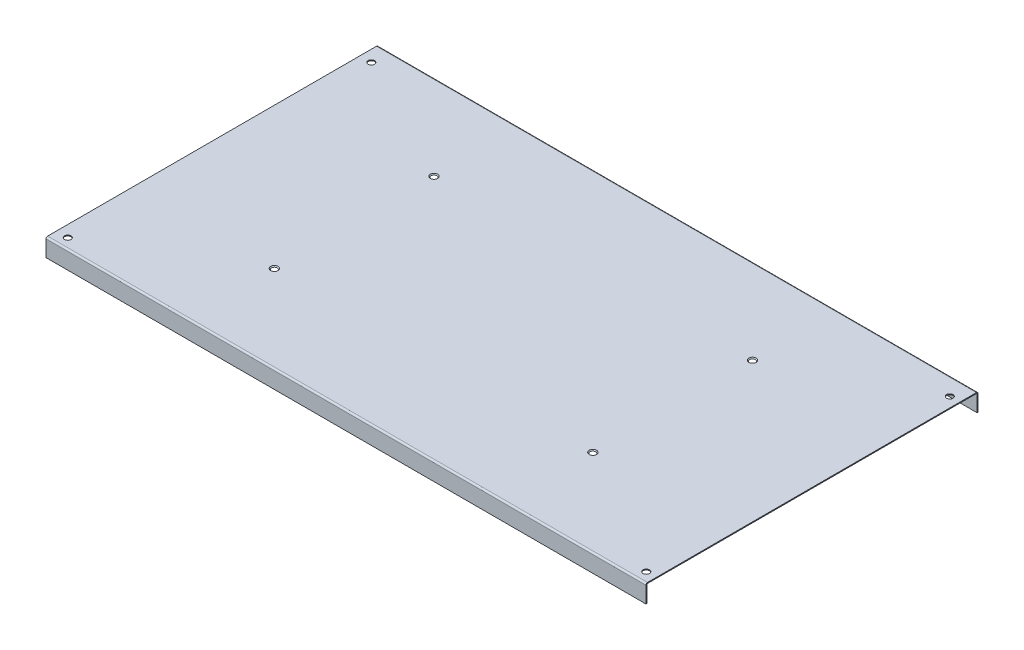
ISO-10303-21;
HEADER;
FILE_DESCRIPTION(('STEP AP214'),'2;1');
FILE_NAME('part.step','',(''),(''),'','','');
FILE_SCHEMA(('AUTOMOTIVE_DESIGN { 1 0 10303 214 1 1 1 1 }'));
ENDSEC;
DATA;
#1=APPLICATION_CONTEXT('core data for automotive mechanical design processes');
#2=APPLICATION_PROTOCOL_DEFINITION('international standard','automotive_design',2000,#1);
#3=PRODUCT_CONTEXT('',#1,'mechanical');
#4=PRODUCT('Part','Part','',(#3));
#5=PRODUCT_RELATED_PRODUCT_CATEGORY('part','',(#4));
#6=PRODUCT_DEFINITION_FORMATION('','',#4);
#7=PRODUCT_DEFINITION_CONTEXT('part definition',#1,'design');
#8=PRODUCT_DEFINITION('design','',#6,#7);
#9=PRODUCT_DEFINITION_SHAPE('','',#8);
#10=(LENGTH_UNIT() NAMED_UNIT(*) SI_UNIT(.MILLI.,.METRE.));
#11=(NAMED_UNIT(*) PLANE_ANGLE_UNIT() SI_UNIT($,.RADIAN.));
#12=(NAMED_UNIT(*) SI_UNIT($,.STERADIAN.) SOLID_ANGLE_UNIT());
#13=UNCERTAINTY_MEASURE_WITH_UNIT(LENGTH_MEASURE(1.E-05),#10,'distance_accuracy_value','');
#14=(GEOMETRIC_REPRESENTATION_CONTEXT(3) GLOBAL_UNCERTAINTY_ASSIGNED_CONTEXT((#13)) GLOBAL_UNIT_ASSIGNED_CONTEXT((#10,
#11,#12)) REPRESENTATION_CONTEXT('',''));
#15=CARTESIAN_POINT('',(0.,0.,0.));
#16=DIRECTION('',(0.,0.,1.));
#17=DIRECTION('',(1.,0.,0.));
#18=AXIS2_PLACEMENT_3D('',#15,#16,#17);
#19=CARTESIAN_POINT('',(840.,0.,-465.));
#20=DIRECTION('',(0.,-1.,0.));
#21=DIRECTION('',(0.,0.,-1.));
#22=AXIS2_PLACEMENT_3D('',#19,#20,#21);
#23=PLANE('',#22);
#24=CARTESIAN_POINT('',(198.,0.,-345.25));
#25=DIRECTION('',(0.,-1.,0.));
#26=DIRECTION('',(0.,0.,-1.));
#27=AXIS2_PLACEMENT_3D('',#24,#25,#26);
#28=CIRCLE('',#27,3.89999999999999);
#29=CARTESIAN_POINT('',(198.,0.,-349.15));
#30=VERTEX_POINT('',#29);
#31=EDGE_CURVE('E279',#30,#30,#28,.T.);
#32=ORIENTED_EDGE('',*,*,#31,.F.);
#33=EDGE_LOOP('',(#32));
#34=FACE_BOUND('',#33,.T.);
#35=CARTESIAN_POINT('',(198.,0.,-121.75));
#36=DIRECTION('',(0.,-1.,0.));
#37=DIRECTION('',(0.,0.,-1.));
#38=AXIS2_PLACEMENT_3D('',#35,#36,#37);
#39=CIRCLE('',#38,3.89999999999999);
#40=CARTESIAN_POINT('',(198.,0.,-125.65));
#41=VERTEX_POINT('',#40);
#42=EDGE_CURVE('E273',#41,#41,#39,.T.);
#43=ORIENTED_EDGE('',*,*,#42,.F.);
#44=EDGE_LOOP('',(#43));
#45=FACE_BOUND('',#44,.T.);
#46=CARTESIAN_POINT('',(644.,0.,-121.75));
#47=DIRECTION('',(0.,-1.,0.));
#48=DIRECTION('',(0.,0.,-1.));
#49=AXIS2_PLACEMENT_3D('',#46,#47,#48);
#50=CIRCLE('',#49,3.9);
#51=CARTESIAN_POINT('',(644.,0.,-125.65));
#52=VERTEX_POINT('',#51);
#53=EDGE_CURVE('E267',#52,#52,#50,.T.);
#54=ORIENTED_EDGE('',*,*,#53,.F.);
#55=EDGE_LOOP('',(#54));
#56=FACE_BOUND('',#55,.T.);
#57=CARTESIAN_POINT('',(644.,0.,-345.25));
#58=DIRECTION('',(0.,-1.,0.));
#59=DIRECTION('',(0.,0.,-1.));
#60=AXIS2_PLACEMENT_3D('',#57,#58,#59);
#61=CIRCLE('',#60,3.9);
#62=CARTESIAN_POINT('',(644.,0.,-349.15));
#63=VERTEX_POINT('',#62);
#64=EDGE_CURVE('E261',#63,#63,#61,.T.);
#65=ORIENTED_EDGE('',*,*,#64,.F.);
#66=EDGE_LOOP('',(#65));
#67=FACE_BOUND('',#66,.T.);
#68=CARTESIAN_POINT('',(15.9999999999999,0.,-439.5));
#69=DIRECTION('',(0.,-1.,0.));
#70=DIRECTION('',(0.,0.,-1.));
#71=AXIS2_PLACEMENT_3D('',#68,#69,#70);
#72=CIRCLE('',#71,4.5);
#73=CARTESIAN_POINT('',(15.9999999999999,0.,-444.));
#74=VERTEX_POINT('',#73);
#75=EDGE_CURVE('E258',#74,#74,#72,.T.);
#76=ORIENTED_EDGE('',*,*,#75,.F.);
#77=EDGE_LOOP('',(#76));
#78=FACE_BOUND('',#77,.T.);
#79=CARTESIAN_POINT('',(826.,0.,-439.5));
#80=DIRECTION('',(0.,-1.,0.));
#81=DIRECTION('',(0.,0.,-1.));
#82=AXIS2_PLACEMENT_3D('',#79,#80,#81);
#83=CIRCLE('',#82,4.49999999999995);
#84=CARTESIAN_POINT('',(826.,0.,-444.));
#85=VERTEX_POINT('',#84);
#86=EDGE_CURVE('E252',#85,#85,#83,.T.);
#87=ORIENTED_EDGE('',*,*,#86,.F.);
#88=EDGE_LOOP('',(#87));
#89=FACE_BOUND('',#88,.T.);
#90=CARTESIAN_POINT('',(826.,0.,-14.5));
#91=DIRECTION('',(0.,-1.,0.));
#92=DIRECTION('',(0.,0.,-1.));
#93=AXIS2_PLACEMENT_3D('',#90,#91,#92);
#94=CIRCLE('',#93,4.49999999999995);
#95=CARTESIAN_POINT('',(826.,0.,-19.));
#96=VERTEX_POINT('',#95);
#97=EDGE_CURVE('E246',#96,#96,#94,.T.);
#98=ORIENTED_EDGE('',*,*,#97,.F.);
#99=EDGE_LOOP('',(#98));
#100=FACE_BOUND('',#99,.T.);
#101=CARTESIAN_POINT('',(15.9999999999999,0.,-14.5));
#102=DIRECTION('',(0.,-1.,0.));
#103=DIRECTION('',(0.,0.,-1.));
#104=AXIS2_PLACEMENT_3D('',#101,#102,#103);
#105=CIRCLE('',#104,4.5);
#106=CARTESIAN_POINT('',(15.9999999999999,0.,-19.));
#107=VERTEX_POINT('',#106);
#108=EDGE_CURVE('E240',#107,#107,#105,.T.);
#109=ORIENTED_EDGE('',*,*,#108,.F.);
#110=EDGE_LOOP('',(#109));
#111=FACE_BOUND('',#110,.T.);
#112=DIRECTION('',(0.,0.,-1.));
#113=VECTOR('',#112,1.);
#114=CARTESIAN_POINT('',(840.,0.,-465.));
#115=LINE('',#114,#113);
#116=CARTESIAN_POINT('',(840.,-5.26271734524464E-13,-2.25));
#117=VERTEX_POINT('',#116);
#118=CARTESIAN_POINT('',(840.,0.,-462.75));
#119=VERTEX_POINT('',#118);
#120=EDGE_CURVE('E232',#117,#119,#115,.T.);
#121=ORIENTED_EDGE('',*,*,#120,.F.);
#122=DIRECTION('',(-1.,0.,0.));
#123=VECTOR('',#122,1.);
#124=CARTESIAN_POINT('',(0.,0.,-2.25));
#125=LINE('',#124,#123);
#126=CARTESIAN_POINT('',(0.,0.,-2.25));
#127=VERTEX_POINT('',#126);
#128=EDGE_CURVE('E192',#127,#117,#125,.F.);
#129=ORIENTED_EDGE('',*,*,#128,.F.);
#130=DIRECTION('',(0.,0.,1.));
#131=VECTOR('',#130,1.);
#132=CARTESIAN_POINT('',(0.,0.,-465.));
#133=LINE('',#132,#131);
#134=CARTESIAN_POINT('',(0.,0.,-462.75));
#135=VERTEX_POINT('',#134);
#136=EDGE_CURVE('E221',#135,#127,#133,.T.);
#137=ORIENTED_EDGE('',*,*,#136,.F.);
#138=DIRECTION('',(1.,0.,0.));
#139=VECTOR('',#138,1.);
#140=CARTESIAN_POINT('',(0.,0.,-462.75));
#141=LINE('',#140,#139);
#142=EDGE_CURVE('E234',#135,#119,#141,.T.);
#143=ORIENTED_EDGE('',*,*,#142,.T.);
#144=EDGE_LOOP('',(#121,#129,#137,#143));
#145=FACE_BOUND('',#144,.T.);
#146=ADVANCED_FACE('F53',(#34,#45,#56,#67,#78,#89,#100,#111,#145),#23,.T.);
#147=CARTESIAN_POINT('',(840.,1.25,-465.));
#148=DIRECTION('',(0.,-1.,0.));
#149=DIRECTION('',(0.,0.,-1.));
#150=AXIS2_PLACEMENT_3D('',#147,#148,#149);
#151=PLANE('',#150);
#152=CARTESIAN_POINT('',(198.,1.25,-121.75));
#153=DIRECTION('',(0.,1.,0.));
#154=DIRECTION('',(0.,0.,1.));
#155=AXIS2_PLACEMENT_3D('',#152,#153,#154);
#156=CIRCLE('',#155,5.14999999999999);
#157=CARTESIAN_POINT('',(198.,1.25,-116.6));
#158=VERTEX_POINT('',#157);
#159=EDGE_CURVE('E276',#158,#158,#156,.T.);
#160=ORIENTED_EDGE('',*,*,#159,.F.);
#161=EDGE_LOOP('',(#160));
#162=FACE_BOUND('',#161,.T.);
#163=CARTESIAN_POINT('',(644.,1.25,-345.25));
#164=DIRECTION('',(0.,1.,0.));
#165=DIRECTION('',(0.,0.,1.));
#166=AXIS2_PLACEMENT_3D('',#163,#164,#165);
#167=CIRCLE('',#166,5.14999999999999);
#168=CARTESIAN_POINT('',(644.,1.25,-340.1));
#169=VERTEX_POINT('',#168);
#170=EDGE_CURVE('E264',#169,#169,#167,.T.);
#171=ORIENTED_EDGE('',*,*,#170,.F.);
#172=EDGE_LOOP('',(#171));
#173=FACE_BOUND('',#172,.T.);
#174=CARTESIAN_POINT('',(15.9999999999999,1.25,-439.5));
#175=DIRECTION('',(0.,1.,0.));
#176=DIRECTION('',(0.,0.,1.));
#177=AXIS2_PLACEMENT_3D('',#174,#175,#176);
#178=CIRCLE('',#177,4.5);
#179=CARTESIAN_POINT('',(15.9999999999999,1.25,-435.));
#180=VERTEX_POINT('',#179);
#181=EDGE_CURVE('E255',#180,#180,#178,.T.);
#182=ORIENTED_EDGE('',*,*,#181,.F.);
#183=EDGE_LOOP('',(#182));
#184=FACE_BOUND('',#183,.T.);
#185=CARTESIAN_POINT('',(826.,1.25,-439.5));
#186=DIRECTION('',(0.,1.,0.));
#187=DIRECTION('',(0.,0.,1.));
#188=AXIS2_PLACEMENT_3D('',#185,#186,#187);
#189=CIRCLE('',#188,4.49999999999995);
#190=CARTESIAN_POINT('',(826.,1.25,-435.));
#191=VERTEX_POINT('',#190);
#192=EDGE_CURVE('E249',#191,#191,#189,.T.);
#193=ORIENTED_EDGE('',*,*,#192,.F.);
#194=EDGE_LOOP('',(#193));
#195=FACE_BOUND('',#194,.T.);
#196=CARTESIAN_POINT('',(826.,1.25,-14.5));
#197=DIRECTION('',(0.,1.,0.));
#198=DIRECTION('',(0.,0.,1.));
#199=AXIS2_PLACEMENT_3D('',#196,#197,#198);
#200=CIRCLE('',#199,4.49999999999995);
#201=CARTESIAN_POINT('',(826.,1.25,-10.0000000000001));
#202=VERTEX_POINT('',#201);
#203=EDGE_CURVE('E243',#202,#202,#200,.T.);
#204=ORIENTED_EDGE('',*,*,#203,.F.);
#205=EDGE_LOOP('',(#204));
#206=FACE_BOUND('',#205,.T.);
#207=CARTESIAN_POINT('',(15.9999999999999,1.25,-14.5));
#208=DIRECTION('',(0.,1.,0.));
#209=DIRECTION('',(0.,0.,1.));
#210=AXIS2_PLACEMENT_3D('',#207,#208,#209);
#211=CIRCLE('',#210,4.5);
#212=CARTESIAN_POINT('',(15.9999999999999,1.25,-10.));
#213=VERTEX_POINT('',#212);
#214=EDGE_CURVE('E237',#213,#213,#211,.T.);
#215=ORIENTED_EDGE('',*,*,#214,.F.);
#216=EDGE_LOOP('',(#215));
#217=FACE_BOUND('',#216,.T.);
#218=CARTESIAN_POINT('',(644.,1.25,-121.75));
#219=DIRECTION('',(0.,1.,0.));
#220=DIRECTION('',(0.,0.,1.));
#221=AXIS2_PLACEMENT_3D('',#218,#219,#220);
#222=CIRCLE('',#221,5.14999999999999);
#223=CARTESIAN_POINT('',(644.,1.25,-116.6));
#224=VERTEX_POINT('',#223);
#225=EDGE_CURVE('E270',#224,#224,#222,.T.);
#226=ORIENTED_EDGE('',*,*,#225,.F.);
#227=EDGE_LOOP('',(#226));
#228=FACE_BOUND('',#227,.T.);
#229=CARTESIAN_POINT('',(198.,1.25,-345.25));
#230=DIRECTION('',(0.,1.,0.));
#231=DIRECTION('',(0.,0.,1.));
#232=AXIS2_PLACEMENT_3D('',#229,#230,#231);
#233=CIRCLE('',#232,5.14999999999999);
#234=CARTESIAN_POINT('',(198.,1.25,-340.1));
#235=VERTEX_POINT('',#234);
#236=EDGE_CURVE('E282',#235,#235,#233,.T.);
#237=ORIENTED_EDGE('',*,*,#236,.F.);
#238=EDGE_LOOP('',(#237));
#239=FACE_BOUND('',#238,.T.);
#240=DIRECTION('',(-1.,0.,0.));
#241=VECTOR('',#240,1.);
#242=CARTESIAN_POINT('',(0.,1.25000000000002,-2.24999999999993));
#243=LINE('',#242,#241);
#244=CARTESIAN_POINT('',(0.,1.25000000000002,-2.24999999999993));
#245=VERTEX_POINT('',#244);
#246=CARTESIAN_POINT('',(840.,1.25,-2.25));
#247=VERTEX_POINT('',#246);
#248=EDGE_CURVE('E197',#245,#247,#243,.F.);
#249=ORIENTED_EDGE('',*,*,#248,.T.);
#250=DIRECTION('',(0.,0.,-1.));
#251=VECTOR('',#250,1.);
#252=CARTESIAN_POINT('',(840.,1.25,-465.));
#253=LINE('',#252,#251);
#254=CARTESIAN_POINT('',(840.,1.25,-462.75));
#255=VERTEX_POINT('',#254);
#256=EDGE_CURVE('E225',#247,#255,#253,.T.);
#257=ORIENTED_EDGE('',*,*,#256,.T.);
#258=DIRECTION('',(1.,0.,0.));
#259=VECTOR('',#258,1.);
#260=CARTESIAN_POINT('',(0.,1.24999999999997,-462.75));
#261=LINE('',#260,#259);
#262=CARTESIAN_POINT('',(0.,1.24999999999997,-462.75));
#263=VERTEX_POINT('',#262);
#264=EDGE_CURVE('E285',#263,#255,#261,.T.);
#265=ORIENTED_EDGE('',*,*,#264,.F.);
#266=DIRECTION('',(0.,0.,1.));
#267=VECTOR('',#266,1.);
#268=CARTESIAN_POINT('',(0.,1.25,-465.));
#269=LINE('',#268,#267);
#270=EDGE_CURVE('E227',#263,#245,#269,.T.);
#271=ORIENTED_EDGE('',*,*,#270,.T.);
#272=EDGE_LOOP('',(#249,#257,#265,#271));
#273=FACE_BOUND('',#272,.T.);
#274=ADVANCED_FACE('F338',(#162,#173,#184,#195,#206,#217,#228,#239,#273),#151,.F.);
#275=CARTESIAN_POINT('',(0.,-1918.05897980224,-465.));
#276=DIRECTION('',(-1.,0.,0.));
#277=DIRECTION('',(0.,0.,1.));
#278=AXIS2_PLACEMENT_3D('',#275,#276,#277);
#279=PLANE('',#278);
#280=ORIENTED_EDGE('',*,*,#136,.T.);
#281=DIRECTION('',(0.,1.,0.));
#282=VECTOR('',#281,1.);
#283=CARTESIAN_POINT('',(0.,0.,-2.25));
#284=LINE('',#283,#282);
#285=EDGE_CURVE('E202',#127,#245,#284,.T.);
#286=ORIENTED_EDGE('',*,*,#285,.T.);
#287=ORIENTED_EDGE('',*,*,#270,.F.);
#288=DIRECTION('',(0.,1.,0.));
#289=VECTOR('',#288,1.);
#290=CARTESIAN_POINT('',(0.,-1918.05897980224,-462.75));
#291=LINE('',#290,#289);
#292=EDGE_CURVE('E220',#135,#263,#291,.T.);
#293=ORIENTED_EDGE('',*,*,#292,.F.);
#294=EDGE_LOOP('',(#280,#286,#287,#293));
#295=FACE_BOUND('',#294,.T.);
#296=ADVANCED_FACE('F332',(#295),#279,.T.);
#297=CARTESIAN_POINT('',(0.,1.25000000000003,1216.86603288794));
#298=DIRECTION('',(-1.,0.,0.));
#299=DIRECTION('',(0.,1.,0.));
#300=AXIS2_PLACEMENT_3D('',#297,#298,#299);
#301=PLANE('',#300);
#302=DIRECTION('',(0.,-1.,0.));
#303=VECTOR('',#302,1.);
#304=CARTESIAN_POINT('',(0.,1.25000000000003,-465.));
#305=LINE('',#304,#303);
#306=CARTESIAN_POINT('',(0.,-1.,-465.));
#307=VERTEX_POINT('',#306);
#308=CARTESIAN_POINT('',(1.11022302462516E-13,-23.7499999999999,-465.));
#309=VERTEX_POINT('',#308);
#310=EDGE_CURVE('E68',#307,#309,#305,.T.);
#311=ORIENTED_EDGE('',*,*,#310,.T.);
#312=DIRECTION('',(0.,0.,-1.));
#313=VECTOR('',#312,1.);
#314=CARTESIAN_POINT('',(1.11022302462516E-13,-23.7499999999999,1216.86603288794));
#315=LINE('',#314,#313);
#316=CARTESIAN_POINT('',(1.11022302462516E-13,-23.7499999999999,-463.75));
#317=VERTEX_POINT('',#316);
#318=EDGE_CURVE('E307',#317,#309,#315,.T.);
#319=ORIENTED_EDGE('',*,*,#318,.F.);
#320=DIRECTION('',(0.,1.,0.));
#321=VECTOR('',#320,1.);
#322=CARTESIAN_POINT('',(0.,1.25000000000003,-463.75));
#323=LINE('',#322,#321);
#324=CARTESIAN_POINT('',(0.,-1.,-463.75));
#325=VERTEX_POINT('',#324);
#326=EDGE_CURVE('E295',#317,#325,#323,.T.);
#327=ORIENTED_EDGE('',*,*,#326,.T.);
#328=DIRECTION('',(0.,0.,-1.));
#329=VECTOR('',#328,1.);
#330=CARTESIAN_POINT('',(0.,-1.,1216.86603288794));
#331=LINE('',#330,#329);
#332=EDGE_CURVE('E309',#325,#307,#331,.T.);
#333=ORIENTED_EDGE('',*,*,#332,.T.);
#334=EDGE_LOOP('',(#311,#319,#327,#333));
#335=FACE_BOUND('',#334,.T.);
#336=ADVANCED_FACE('F55',(#335),#301,.T.);
#337=CARTESIAN_POINT('',(840.,-23.7499999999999,1216.86603288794));
#338=DIRECTION('',(0.,-1.,0.));
#339=DIRECTION('',(0.,0.,-1.));
#340=AXIS2_PLACEMENT_3D('',#337,#338,#339);
#341=PLANE('',#340);
#342=DIRECTION('',(-1.,0.,0.));
#343=VECTOR('',#342,1.);
#344=CARTESIAN_POINT('',(840.,-23.7499999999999,-465.));
#345=LINE('',#344,#343);
#346=CARTESIAN_POINT('',(840.,-23.7499999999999,-465.));
#347=VERTEX_POINT('',#346);
#348=EDGE_CURVE('E224',#347,#309,#345,.T.);
#349=ORIENTED_EDGE('',*,*,#348,.F.);
#350=DIRECTION('',(0.,0.,-1.));
#351=VECTOR('',#350,1.);
#352=CARTESIAN_POINT('',(840.,-23.7499999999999,1216.86603288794));
#353=LINE('',#352,#351);
#354=CARTESIAN_POINT('',(840.,-23.7499999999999,-463.75));
#355=VERTEX_POINT('',#354);
#356=EDGE_CURVE('E305',#355,#347,#353,.T.);
#357=ORIENTED_EDGE('',*,*,#356,.F.);
#358=DIRECTION('',(-1.,0.,0.));
#359=VECTOR('',#358,1.);
#360=CARTESIAN_POINT('',(840.,-23.7499999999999,-463.75));
#361=LINE('',#360,#359);
#362=EDGE_CURVE('E75',#355,#317,#361,.T.);
#363=ORIENTED_EDGE('',*,*,#362,.T.);
#364=ORIENTED_EDGE('',*,*,#318,.T.);
#365=EDGE_LOOP('',(#349,#357,#363,#364));
#366=FACE_BOUND('',#365,.T.);
#367=ADVANCED_FACE('F319',(#366),#341,.T.);
#368=CARTESIAN_POINT('',(840.,1.25000000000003,1216.86603288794));
#369=DIRECTION('',(1.,0.,0.));
#370=DIRECTION('',(0.,-1.,0.));
#371=AXIS2_PLACEMENT_3D('',#368,#369,#370);
#372=PLANE('',#371);
#373=DIRECTION('',(0.,-1.,0.));
#374=VECTOR('',#373,1.);
#375=CARTESIAN_POINT('',(840.,1.25000000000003,-465.));
#376=LINE('',#375,#374);
#377=CARTESIAN_POINT('',(840.,-1.,-465.));
#378=VERTEX_POINT('',#377);
#379=EDGE_CURVE('E13',#378,#347,#376,.T.);
#380=ORIENTED_EDGE('',*,*,#379,.F.);
#381=DIRECTION('',(0.,0.,-1.));
#382=VECTOR('',#381,1.);
#383=CARTESIAN_POINT('',(840.,-1.,1216.86603288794));
#384=LINE('',#383,#382);
#385=CARTESIAN_POINT('',(840.,-0.999999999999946,-463.75));
#386=VERTEX_POINT('',#385);
#387=EDGE_CURVE('E302',#386,#378,#384,.T.);
#388=ORIENTED_EDGE('',*,*,#387,.F.);
#389=DIRECTION('',(0.,1.,0.));
#390=VECTOR('',#389,1.);
#391=CARTESIAN_POINT('',(840.,1.25000000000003,-463.75));
#392=LINE('',#391,#390);
#393=EDGE_CURVE('E61',#355,#386,#392,.T.);
#394=ORIENTED_EDGE('',*,*,#393,.F.);
#395=ORIENTED_EDGE('',*,*,#356,.T.);
#396=EDGE_LOOP('',(#380,#388,#394,#395));
#397=FACE_BOUND('',#396,.T.);
#398=ADVANCED_FACE('F317',(#397),#372,.T.);
#399=CARTESIAN_POINT('',(840.,-23.7499999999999,-463.75));
#400=DIRECTION('',(0.,0.,-1.));
#401=DIRECTION('',(-1.,0.,0.));
#402=AXIS2_PLACEMENT_3D('',#399,#400,#401);
#403=PLANE('',#402);
#404=ORIENTED_EDGE('',*,*,#393,.T.);
#405=DIRECTION('',(-1.,0.,0.));
#406=VECTOR('',#405,1.);
#407=CARTESIAN_POINT('',(0.,-1.,-463.75));
#408=LINE('',#407,#406);
#409=EDGE_CURVE('E299',#386,#325,#408,.T.);
#410=ORIENTED_EDGE('',*,*,#409,.T.);
#411=ORIENTED_EDGE('',*,*,#326,.F.);
#412=ORIENTED_EDGE('',*,*,#362,.F.);
#413=EDGE_LOOP('',(#404,#410,#411,#412));
#414=FACE_BOUND('',#413,.T.);
#415=ADVANCED_FACE('F312',(#414),#403,.F.);
#416=CARTESIAN_POINT('',(0.,1.25000000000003,-465.));
#417=DIRECTION('',(0.,0.,1.));
#418=DIRECTION('',(1.,0.,0.));
#419=AXIS2_PLACEMENT_3D('',#416,#417,#418);
#420=PLANE('',#419);
#421=ORIENTED_EDGE('',*,*,#310,.F.);
#422=DIRECTION('',(1.,0.,0.));
#423=VECTOR('',#422,1.);
#424=CARTESIAN_POINT('',(0.,-1.,-465.));
#425=LINE('',#424,#423);
#426=EDGE_CURVE('E292',#307,#378,#425,.T.);
#427=ORIENTED_EDGE('',*,*,#426,.T.);
#428=ORIENTED_EDGE('',*,*,#379,.T.);
#429=ORIENTED_EDGE('',*,*,#348,.T.);
#430=EDGE_LOOP('',(#421,#427,#428,#429));
#431=FACE_BOUND('',#430,.T.);
#432=ADVANCED_FACE('F321',(#431),#420,.F.);
#433=CARTESIAN_POINT('',(198.,1.25,-345.25));
#434=DIRECTION('',(0.,1.,0.));
#435=DIRECTION('',(0.,0.,1.));
#436=AXIS2_PLACEMENT_3D('',#433,#434,#435);
#437=CONICAL_SURFACE('',#436,5.14999999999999,0.785398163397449);
#438=ORIENTED_EDGE('',*,*,#236,.T.);
#439=EDGE_LOOP('',(#438));
#440=FACE_BOUND('',#439,.T.);
#441=ORIENTED_EDGE('',*,*,#31,.T.);
#442=EDGE_LOOP('',(#441));
#443=FACE_BOUND('',#442,.T.);
#444=ADVANCED_FACE('F363',(#440,#443),#437,.F.);
#445=CARTESIAN_POINT('',(198.,1.25,-121.75));
#446=DIRECTION('',(0.,1.,0.));
#447=DIRECTION('',(0.,0.,1.));
#448=AXIS2_PLACEMENT_3D('',#445,#446,#447);
#449=CONICAL_SURFACE('',#448,5.14999999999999,0.785398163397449);
#450=ORIENTED_EDGE('',*,*,#159,.T.);
#451=EDGE_LOOP('',(#450));
#452=FACE_BOUND('',#451,.T.);
#453=ORIENTED_EDGE('',*,*,#42,.T.);
#454=EDGE_LOOP('',(#453));
#455=FACE_BOUND('',#454,.T.);
#456=ADVANCED_FACE('F378',(#452,#455),#449,.F.);
#457=CARTESIAN_POINT('',(644.,1.25,-121.75));
#458=DIRECTION('',(0.,1.,0.));
#459=DIRECTION('',(0.,0.,1.));
#460=AXIS2_PLACEMENT_3D('',#457,#458,#459);
#461=CONICAL_SURFACE('',#460,5.14999999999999,0.785398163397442);
#462=ORIENTED_EDGE('',*,*,#225,.T.);
#463=EDGE_LOOP('',(#462));
#464=FACE_BOUND('',#463,.T.);
#465=ORIENTED_EDGE('',*,*,#53,.T.);
#466=EDGE_LOOP('',(#465));
#467=FACE_BOUND('',#466,.T.);
#468=ADVANCED_FACE('F387',(#464,#467),#461,.F.);
#469=CARTESIAN_POINT('',(644.,1.25,-345.25));
#470=DIRECTION('',(0.,1.,0.));
#471=DIRECTION('',(0.,0.,1.));
#472=AXIS2_PLACEMENT_3D('',#469,#470,#471);
#473=CONICAL_SURFACE('',#472,5.14999999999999,0.785398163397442);
#474=ORIENTED_EDGE('',*,*,#170,.T.);
#475=EDGE_LOOP('',(#474));
#476=FACE_BOUND('',#475,.T.);
#477=ORIENTED_EDGE('',*,*,#64,.T.);
#478=EDGE_LOOP('',(#477));
#479=FACE_BOUND('',#478,.T.);
#480=ADVANCED_FACE('F395',(#476,#479),#473,.F.);
#481=CARTESIAN_POINT('',(15.9999999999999,1.25,-439.5));
#482=DIRECTION('',(0.,1.,0.));
#483=DIRECTION('',(0.,0.,1.));
#484=AXIS2_PLACEMENT_3D('',#481,#482,#483);
#485=CYLINDRICAL_SURFACE('',#484,4.5);
#486=ORIENTED_EDGE('',*,*,#75,.T.);
#487=EDGE_LOOP('',(#486));
#488=FACE_BOUND('',#487,.T.);
#489=ORIENTED_EDGE('',*,*,#181,.T.);
#490=EDGE_LOOP('',(#489));
#491=FACE_BOUND('',#490,.T.);
#492=ADVANCED_FACE('F403',(#488,#491),#485,.F.);
#493=CARTESIAN_POINT('',(826.,1.25,-439.5));
#494=DIRECTION('',(0.,1.,0.));
#495=DIRECTION('',(0.,0.,1.));
#496=AXIS2_PLACEMENT_3D('',#493,#494,#495);
#497=CYLINDRICAL_SURFACE('',#496,4.49999999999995);
#498=ORIENTED_EDGE('',*,*,#86,.T.);
#499=EDGE_LOOP('',(#498));
#500=FACE_BOUND('',#499,.T.);
#501=ORIENTED_EDGE('',*,*,#192,.T.);
#502=EDGE_LOOP('',(#501));
#503=FACE_BOUND('',#502,.T.);
#504=ADVANCED_FACE('F411',(#500,#503),#497,.F.);
#505=CARTESIAN_POINT('',(826.,1.25,-14.5));
#506=DIRECTION('',(0.,1.,0.));
#507=DIRECTION('',(0.,0.,1.));
#508=AXIS2_PLACEMENT_3D('',#505,#506,#507);
#509=CYLINDRICAL_SURFACE('',#508,4.49999999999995);
#510=ORIENTED_EDGE('',*,*,#97,.T.);
#511=EDGE_LOOP('',(#510));
#512=FACE_BOUND('',#511,.T.);
#513=ORIENTED_EDGE('',*,*,#203,.T.);
#514=EDGE_LOOP('',(#513));
#515=FACE_BOUND('',#514,.T.);
#516=ADVANCED_FACE('F419',(#512,#515),#509,.F.);
#517=CARTESIAN_POINT('',(15.9999999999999,1.25,-14.5));
#518=DIRECTION('',(0.,1.,0.));
#519=DIRECTION('',(0.,0.,1.));
#520=AXIS2_PLACEMENT_3D('',#517,#518,#519);
#521=CYLINDRICAL_SURFACE('',#520,4.5);
#522=ORIENTED_EDGE('',*,*,#108,.T.);
#523=EDGE_LOOP('',(#522));
#524=FACE_BOUND('',#523,.T.);
#525=ORIENTED_EDGE('',*,*,#214,.T.);
#526=EDGE_LOOP('',(#525));
#527=FACE_BOUND('',#526,.T.);
#528=ADVANCED_FACE('F354',(#524,#527),#521,.F.);
#529=CARTESIAN_POINT('',(840.,-1918.05897980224,-465.));
#530=DIRECTION('',(1.,0.,0.));
#531=DIRECTION('',(0.,0.,-1.));
#532=AXIS2_PLACEMENT_3D('',#529,#530,#531);
#533=PLANE('',#532);
#534=DIRECTION('',(0.,1.,0.));
#535=VECTOR('',#534,1.);
#536=CARTESIAN_POINT('',(840.,-5.26271734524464E-13,-2.25));
#537=LINE('',#536,#535);
#538=EDGE_CURVE('E205',#117,#247,#537,.T.);
#539=ORIENTED_EDGE('',*,*,#538,.F.);
#540=ORIENTED_EDGE('',*,*,#120,.T.);
#541=DIRECTION('',(0.,1.,0.));
#542=VECTOR('',#541,1.);
#543=CARTESIAN_POINT('',(840.,-1918.05897980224,-462.75));
#544=LINE('',#543,#542);
#545=EDGE_CURVE('E229',#119,#255,#544,.T.);
#546=ORIENTED_EDGE('',*,*,#545,.T.);
#547=ORIENTED_EDGE('',*,*,#256,.F.);
#548=EDGE_LOOP('',(#539,#540,#546,#547));
#549=FACE_BOUND('',#548,.T.);
#550=ADVANCED_FACE('F356',(#549),#533,.T.);
#551=CARTESIAN_POINT('',(840.,-1.,-462.75));
#552=DIRECTION('',(1.,0.,0.));
#553=DIRECTION('',(0.,0.,-1.));
#554=AXIS2_PLACEMENT_3D('',#551,#552,#553);
#555=PLANE('',#554);
#556=ORIENTED_EDGE('',*,*,#545,.F.);
#557=CARTESIAN_POINT('',(840.,-1.,-462.75));
#558=DIRECTION('',(1.,0.,0.));
#559=DIRECTION('',(0.,0.,-1.));
#560=AXIS2_PLACEMENT_3D('',#557,#558,#559);
#561=CIRCLE('',#560,0.999999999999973);
#562=EDGE_CURVE('E212',#119,#386,#561,.F.);
#563=ORIENTED_EDGE('',*,*,#562,.T.);
#564=ORIENTED_EDGE('',*,*,#387,.T.);
#565=CARTESIAN_POINT('',(840.,-1.,-462.75));
#566=DIRECTION('',(1.,0.,0.));
#567=DIRECTION('',(0.,0.,-1.));
#568=AXIS2_PLACEMENT_3D('',#565,#566,#567);
#569=CIRCLE('',#568,2.24999999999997);
#570=EDGE_CURVE('E218',#255,#378,#569,.F.);
#571=ORIENTED_EDGE('',*,*,#570,.F.);
#572=EDGE_LOOP('',(#556,#563,#564,#571));
#573=FACE_BOUND('',#572,.T.);
#574=ADVANCED_FACE('F358',(#573),#555,.T.);
#575=CARTESIAN_POINT('',(0.,-1.,-462.75));
#576=DIRECTION('',(-1.,0.,0.));
#577=DIRECTION('',(0.,0.,1.));
#578=AXIS2_PLACEMENT_3D('',#575,#576,#577);
#579=PLANE('',#578);
#580=ORIENTED_EDGE('',*,*,#332,.F.);
#581=CARTESIAN_POINT('',(0.,-1.,-462.75));
#582=DIRECTION('',(1.,0.,0.));
#583=DIRECTION('',(0.,0.,-1.));
#584=AXIS2_PLACEMENT_3D('',#581,#582,#583);
#585=CIRCLE('',#584,0.999999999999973);
#586=EDGE_CURVE('E208',#325,#135,#585,.T.);
#587=ORIENTED_EDGE('',*,*,#586,.T.);
#588=ORIENTED_EDGE('',*,*,#292,.T.);
#589=CARTESIAN_POINT('',(0.,-1.,-462.75));
#590=DIRECTION('',(1.,0.,0.));
#591=DIRECTION('',(0.,0.,-1.));
#592=AXIS2_PLACEMENT_3D('',#589,#590,#591);
#593=CIRCLE('',#592,2.24999999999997);
#594=EDGE_CURVE('E215',#307,#263,#593,.T.);
#595=ORIENTED_EDGE('',*,*,#594,.F.);
#596=EDGE_LOOP('',(#580,#587,#588,#595));
#597=FACE_BOUND('',#596,.T.);
#598=ADVANCED_FACE('F328',(#597),#579,.T.);
#599=CARTESIAN_POINT('',(-971.492073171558,-1.,-462.75));
#600=DIRECTION('',(1.,0.,0.));
#601=DIRECTION('',(0.,0.,-1.));
#602=AXIS2_PLACEMENT_3D('',#599,#600,#601);
#603=CYLINDRICAL_SURFACE('',#602,2.24999999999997);
#604=ORIENTED_EDGE('',*,*,#594,.T.);
#605=ORIENTED_EDGE('',*,*,#264,.T.);
#606=ORIENTED_EDGE('',*,*,#570,.T.);
#607=ORIENTED_EDGE('',*,*,#426,.F.);
#608=EDGE_LOOP('',(#604,#605,#606,#607));
#609=FACE_BOUND('',#608,.T.);
#610=ADVANCED_FACE('F324',(#609),#603,.T.);
#611=CARTESIAN_POINT('',(-971.492073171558,-1.,-462.75));
#612=DIRECTION('',(1.,0.,0.));
#613=DIRECTION('',(0.,0.,-1.));
#614=AXIS2_PLACEMENT_3D('',#611,#612,#613);
#615=CYLINDRICAL_SURFACE('',#614,0.999999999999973);
#616=ORIENTED_EDGE('',*,*,#586,.F.);
#617=ORIENTED_EDGE('',*,*,#409,.F.);
#618=ORIENTED_EDGE('',*,*,#562,.F.);
#619=ORIENTED_EDGE('',*,*,#142,.F.);
#620=EDGE_LOOP('',(#616,#617,#618,#619));
#621=FACE_BOUND('',#620,.T.);
#622=ADVANCED_FACE('F466',(#621),#615,.F.);
#623=CARTESIAN_POINT('',(840.,-1.00000000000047,-2.25000000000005));
#624=DIRECTION('',(1.,0.,0.));
#625=DIRECTION('',(0.,1.,0.));
#626=AXIS2_PLACEMENT_3D('',#623,#624,#625);
#627=PLANE('',#626);
#628=DIRECTION('',(0.,0.,1.));
#629=VECTOR('',#628,1.);
#630=CARTESIAN_POINT('',(840.,-1.00000000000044,0.));
#631=LINE('',#630,#629);
#632=CARTESIAN_POINT('',(840.,-1.00000000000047,-1.2500000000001));
#633=VERTEX_POINT('',#632);
#634=CARTESIAN_POINT('',(840.,-1.00000000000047,0.));
#635=VERTEX_POINT('',#634);
#636=EDGE_CURVE('E185',#633,#635,#631,.T.);
#637=ORIENTED_EDGE('',*,*,#636,.F.);
#638=CARTESIAN_POINT('',(840.,-1.00000000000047,-2.25000000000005));
#639=DIRECTION('',(-1.,0.,0.));
#640=DIRECTION('',(0.,-1.,0.));
#641=AXIS2_PLACEMENT_3D('',#638,#639,#640);
#642=CIRCLE('',#641,0.999999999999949);
#643=EDGE_CURVE('E188',#117,#633,#642,.F.);
#644=ORIENTED_EDGE('',*,*,#643,.F.);
#645=ORIENTED_EDGE('',*,*,#538,.T.);
#646=CARTESIAN_POINT('',(840.,-1.00000000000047,-2.25000000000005));
#647=DIRECTION('',(-1.,0.,0.));
#648=DIRECTION('',(0.,-1.,0.));
#649=AXIS2_PLACEMENT_3D('',#646,#647,#648);
#650=CIRCLE('',#649,2.24999999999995);
#651=EDGE_CURVE('E199',#247,#635,#650,.F.);
#652=ORIENTED_EDGE('',*,*,#651,.T.);
#653=EDGE_LOOP('',(#637,#644,#645,#652));
#654=FACE_BOUND('',#653,.T.);
#655=ADVANCED_FACE('F462',(#654),#627,.T.);
#656=CARTESIAN_POINT('',(0.,-0.999999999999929,-2.25000000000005));
#657=DIRECTION('',(1.,0.,0.));
#658=DIRECTION('',(0.,1.,0.));
#659=AXIS2_PLACEMENT_3D('',#656,#657,#658);
#660=PLANE('',#659);
#661=CARTESIAN_POINT('',(0.,-0.999999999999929,-2.25000000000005));
#662=DIRECTION('',(-1.,0.,0.));
#663=DIRECTION('',(0.,-1.,0.));
#664=AXIS2_PLACEMENT_3D('',#661,#662,#663);
#665=CIRCLE('',#664,0.999999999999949);
#666=CARTESIAN_POINT('',(0.,-0.999999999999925,-1.2500000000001));
#667=VERTEX_POINT('',#666);
#668=EDGE_CURVE('E155',#667,#127,#665,.T.);
#669=ORIENTED_EDGE('',*,*,#668,.F.);
#670=DIRECTION('',(0.,0.,1.));
#671=VECTOR('',#670,1.);
#672=CARTESIAN_POINT('',(0.,-0.999999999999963,-1.25));
#673=LINE('',#672,#671);
#674=CARTESIAN_POINT('',(0.,-0.999999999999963,0.));
#675=VERTEX_POINT('',#674);
#676=EDGE_CURVE('E180',#667,#675,#673,.T.);
#677=ORIENTED_EDGE('',*,*,#676,.T.);
#678=CARTESIAN_POINT('',(0.,-0.999999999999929,-2.25000000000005));
#679=DIRECTION('',(-1.,0.,0.));
#680=DIRECTION('',(0.,-1.,0.));
#681=AXIS2_PLACEMENT_3D('',#678,#679,#680);
#682=CIRCLE('',#681,2.24999999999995);
#683=EDGE_CURVE('E191',#675,#245,#682,.T.);
#684=ORIENTED_EDGE('',*,*,#683,.T.);
#685=ORIENTED_EDGE('',*,*,#285,.F.);
#686=EDGE_LOOP('',(#669,#677,#684,#685));
#687=FACE_BOUND('',#686,.T.);
#688=ADVANCED_FACE('F465',(#687),#660,.F.);
#689=CARTESIAN_POINT('',(0.,-0.999999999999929,-2.25000000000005));
#690=DIRECTION('',(-1.,0.,0.));
#691=DIRECTION('',(0.,0.,1.));
#692=AXIS2_PLACEMENT_3D('',#689,#690,#691);
#693=CYLINDRICAL_SURFACE('',#692,2.24999999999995);
#694=ORIENTED_EDGE('',*,*,#248,.F.);
#695=ORIENTED_EDGE('',*,*,#683,.F.);
#696=DIRECTION('',(-1.,0.,0.));
#697=VECTOR('',#696,1.);
#698=CARTESIAN_POINT('',(840.,-1.00000000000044,0.));
#699=LINE('',#698,#697);
#700=EDGE_CURVE('E169',#675,#635,#699,.F.);
#701=ORIENTED_EDGE('',*,*,#700,.T.);
#702=ORIENTED_EDGE('',*,*,#651,.F.);
#703=EDGE_LOOP('',(#694,#695,#701,#702));
#704=FACE_BOUND('',#703,.T.);
#705=ADVANCED_FACE('F469',(#704),#693,.T.);
#706=CARTESIAN_POINT('',(0.,-0.999999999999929,-2.25000000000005));
#707=DIRECTION('',(-1.,0.,0.));
#708=DIRECTION('',(0.,0.,1.));
#709=AXIS2_PLACEMENT_3D('',#706,#707,#708);
#710=CYLINDRICAL_SURFACE('',#709,0.999999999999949);
#711=ORIENTED_EDGE('',*,*,#128,.T.);
#712=ORIENTED_EDGE('',*,*,#643,.T.);
#713=DIRECTION('',(-1.,0.,0.));
#714=VECTOR('',#713,1.);
#715=CARTESIAN_POINT('',(840.,-1.00000000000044,-1.2500000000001));
#716=LINE('',#715,#714);
#717=EDGE_CURVE('E183',#633,#667,#716,.T.);
#718=ORIENTED_EDGE('',*,*,#717,.T.);
#719=ORIENTED_EDGE('',*,*,#668,.T.);
#720=EDGE_LOOP('',(#711,#712,#718,#719));
#721=FACE_BOUND('',#720,.T.);
#722=ADVANCED_FACE('F478',(#721),#710,.F.);
#723=CARTESIAN_POINT('',(0.,0.,0.));
#724=DIRECTION('',(-1.,0.,0.));
#725=DIRECTION('',(0.,-1.,0.));
#726=AXIS2_PLACEMENT_3D('',#723,#724,#725);
#727=PLANE('',#726);
#728=DIRECTION('',(0.,-1.,0.));
#729=VECTOR('',#728,1.);
#730=CARTESIAN_POINT('',(0.,0.,0.));
#731=LINE('',#730,#729);
#732=CARTESIAN_POINT('',(-2.77555756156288E-13,-23.7499999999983,0.));
#733=VERTEX_POINT('',#732);
#734=EDGE_CURVE('E149',#733,#675,#731,.F.);
#735=ORIENTED_EDGE('',*,*,#734,.T.);
#736=ORIENTED_EDGE('',*,*,#676,.F.);
#737=DIRECTION('',(0.,1.,0.));
#738=VECTOR('',#737,1.);
#739=CARTESIAN_POINT('',(0.,9.36568074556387E-12,-1.25));
#740=LINE('',#739,#738);
#741=CARTESIAN_POINT('',(-2.77594025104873E-13,-23.7499999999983,-1.24999999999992));
#742=VERTEX_POINT('',#741);
#743=EDGE_CURVE('E151',#742,#667,#740,.T.);
#744=ORIENTED_EDGE('',*,*,#743,.F.);
#745=DIRECTION('',(0.,0.,-1.));
#746=VECTOR('',#745,1.);
#747=CARTESIAN_POINT('',(-2.77555756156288E-13,-23.7499999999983,0.));
#748=LINE('',#747,#746);
#749=EDGE_CURVE('E144',#733,#742,#748,.T.);
#750=ORIENTED_EDGE('',*,*,#749,.F.);
#751=EDGE_LOOP('',(#735,#736,#744,#750));
#752=FACE_BOUND('',#751,.T.);
#753=ADVANCED_FACE('F146',(#752),#727,.T.);
#754=CARTESIAN_POINT('',(840.,-23.7499999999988,0.));
#755=DIRECTION('',(1.,0.,0.));
#756=DIRECTION('',(0.,1.,0.));
#757=AXIS2_PLACEMENT_3D('',#754,#755,#756);
#758=PLANE('',#757);
#759=DIRECTION('',(0.,-1.,0.));
#760=VECTOR('',#759,1.);
#761=CARTESIAN_POINT('',(840.,-4.5102810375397E-13,-1.2500000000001));
#762=LINE('',#761,#760);
#763=CARTESIAN_POINT('',(840.,-23.7499999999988,-1.25000000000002));
#764=VERTEX_POINT('',#763);
#765=EDGE_CURVE('E177',#633,#764,#762,.T.);
#766=ORIENTED_EDGE('',*,*,#765,.F.);
#767=ORIENTED_EDGE('',*,*,#636,.T.);
#768=DIRECTION('',(0.,1.,0.));
#769=VECTOR('',#768,1.);
#770=CARTESIAN_POINT('',(840.,-23.7499999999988,0.));
#771=LINE('',#770,#769);
#772=CARTESIAN_POINT('',(840.,-23.7499999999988,0.));
#773=VERTEX_POINT('',#772);
#774=EDGE_CURVE('E165',#635,#773,#771,.F.);
#775=ORIENTED_EDGE('',*,*,#774,.T.);
#776=DIRECTION('',(0.,0.,-1.));
#777=VECTOR('',#776,1.);
#778=CARTESIAN_POINT('',(840.,-23.7499999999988,0.));
#779=LINE('',#778,#777);
#780=EDGE_CURVE('E156',#773,#764,#779,.T.);
#781=ORIENTED_EDGE('',*,*,#780,.T.);
#782=EDGE_LOOP('',(#766,#767,#775,#781));
#783=FACE_BOUND('',#782,.T.);
#784=ADVANCED_FACE('F501',(#783),#758,.T.);
#785=CARTESIAN_POINT('',(840.,-4.46663749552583E-13,-1.02782365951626E-13));
#786=DIRECTION('',(0.,0.,-1.));
#787=DIRECTION('',(0.,1.,0.));
#788=AXIS2_PLACEMENT_3D('',#785,#786,#787);
#789=PLANE('',#788);
#790=ORIENTED_EDGE('',*,*,#700,.F.);
#791=ORIENTED_EDGE('',*,*,#734,.F.);
#792=DIRECTION('',(1.,0.,0.));
#793=VECTOR('',#792,1.);
#794=CARTESIAN_POINT('',(-2.77555756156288E-13,-23.7499999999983,0.));
#795=LINE('',#794,#793);
#796=EDGE_CURVE('E160',#773,#733,#795,.F.);
#797=ORIENTED_EDGE('',*,*,#796,.F.);
#798=ORIENTED_EDGE('',*,*,#774,.F.);
#799=EDGE_LOOP('',(#790,#791,#797,#798));
#800=FACE_BOUND('',#799,.T.);
#801=ADVANCED_FACE('F168',(#800),#789,.F.);
#802=CARTESIAN_POINT('',(840.,-4.5102810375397E-13,-1.2500000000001));
#803=DIRECTION('',(0.,0.,-1.));
#804=DIRECTION('',(0.,1.,0.));
#805=AXIS2_PLACEMENT_3D('',#802,#803,#804);
#806=PLANE('',#805);
#807=ORIENTED_EDGE('',*,*,#743,.T.);
#808=ORIENTED_EDGE('',*,*,#717,.F.);
#809=ORIENTED_EDGE('',*,*,#765,.T.);
#810=DIRECTION('',(-1.,0.,0.));
#811=VECTOR('',#810,1.);
#812=CARTESIAN_POINT('',(840.,-23.7499999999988,-1.25000000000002));
#813=LINE('',#812,#811);
#814=EDGE_CURVE('E175',#764,#742,#813,.T.);
#815=ORIENTED_EDGE('',*,*,#814,.T.);
#816=EDGE_LOOP('',(#807,#808,#809,#815));
#817=FACE_BOUND('',#816,.T.);
#818=ADVANCED_FACE('F517',(#817),#806,.T.);
#819=CARTESIAN_POINT('',(-2.77555756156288E-13,-23.7499999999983,0.));
#820=DIRECTION('',(0.,-1.,0.));
#821=DIRECTION('',(0.,0.,-1.));
#822=AXIS2_PLACEMENT_3D('',#819,#820,#821);
#823=PLANE('',#822);
#824=ORIENTED_EDGE('',*,*,#814,.F.);
#825=ORIENTED_EDGE('',*,*,#780,.F.);
#826=ORIENTED_EDGE('',*,*,#796,.T.);
#827=ORIENTED_EDGE('',*,*,#749,.T.);
#828=EDGE_LOOP('',(#824,#825,#826,#827));
#829=FACE_BOUND('',#828,.T.);
#830=ADVANCED_FACE('F161',(#829),#823,.T.);
#831=CLOSED_SHELL('',(#146,#274,#296,#336,#367,#398,#415,#432,#444,#456,#468,#480,#492,#504,
#516,#528,#550,#574,#598,#610,#622,#655,#688,#705,#722,#753,#784,#801,#818,#830));
#832=MANIFOLD_SOLID_BREP('B2',#831);
#833=ADVANCED_BREP_SHAPE_REPRESENTATION('',(#18,#832),#14);
#834=SHAPE_DEFINITION_REPRESENTATION(#9,#833);
ENDSEC;
END-ISO-10303-21;
